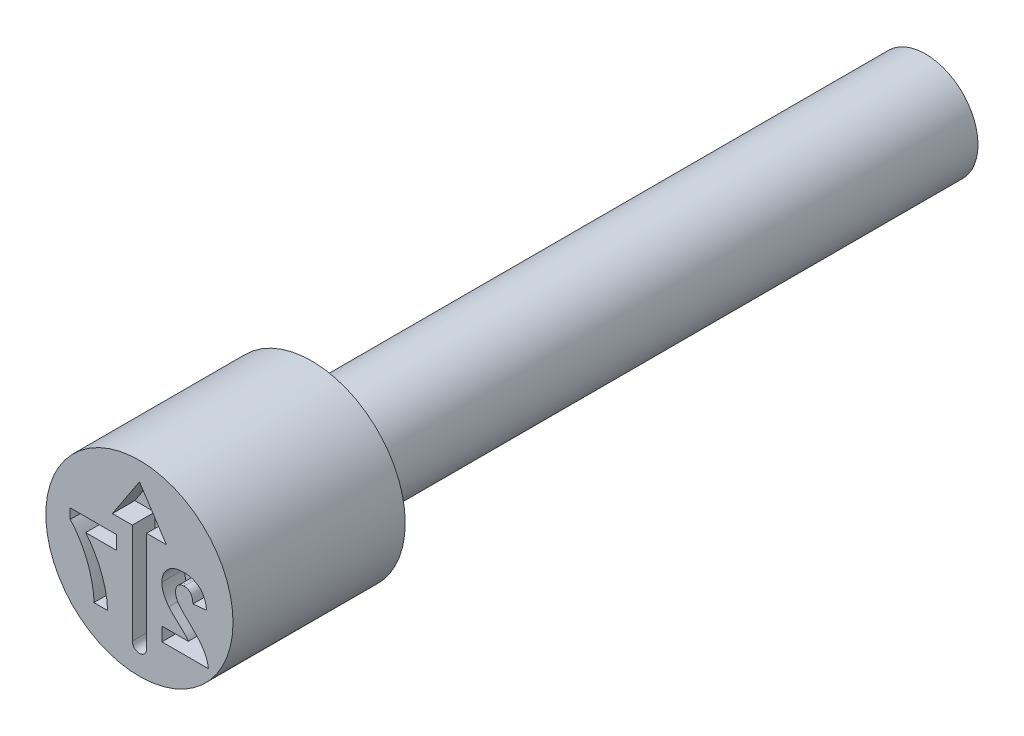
from build123d import *

# Parameters (mm, degrees)
CUT_EXTRUDE4_DEPTH = 0.3
CUT_EXTRUDE5_DEPTH = 0.3


with BuildPart() as part:
    # Sketch2 → Revolve1 (revolve)
    with BuildSketch(Plane(origin=(0, 0, 0), x_dir=(0, 0, -1), z_dir=(1, 0, 0)), mode=Mode.PRIVATE) as revolve1_sk:
        Polygon((0, 1.25), (0, 0), (10.5, 0), (10.5, 0.7), (2.3, 0.7), (2.3, 1.25), align=None)
    revolve(revolve1_sk.sketch.rotate(Axis((0, 0, -0.403888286), (0, 0, -1)), 90), axis=Axis((0, 0, -0.403888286), (0, 0, -1)))

    # Sketch3 → Cut-Extrude4 (cut)
    with BuildSketch(Plane.XY):
        with BuildLine():
            Line((0.095236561, 0.453175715), (0.095236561, -0.888080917))
            ThreePointArc((0.095236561, -0.888080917), (0, -0.983317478), (-0.095236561, -0.888080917))
            Line((-0.095236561, -0.888080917), (-0.095236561, 0.453175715))
            Line((-0.095236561, 0.453175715), (-0.360958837, 0.453175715))
            Line((-0.360958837, 0.453175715), (0, 1.001057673))
            Line((0, 1.001057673), (0.360958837, 0.453175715))
            Line((0.360958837, 0.453175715), (0.095236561, 0.453175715))
        make_face()
    extrude(amount=-CUT_EXTRUDE4_DEPTH, mode=Mode.SUBTRACT)

    # Sketch4 → Cut-Extrude5 (cut)
    with BuildSketch(Plane.XY):
        with BuildLine():
            Line((0.300150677, -0.517307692), (0.300150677, -0.7))
            Line((0.300150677, -0.7), (0.921304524, -0.7))
            add(Edge.make_bspline(
                [(0.921304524, -0.7), (0.919201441, -0.684386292), (0.914996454, -0.65316763), (0.901996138, -0.607565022), (0.884645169, -0.563064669), (0.865813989, -0.526852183), (0.847084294, -0.497702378), (0.830090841, -0.473816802), (0.809818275, -0.448403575), (0.786560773, -0.421257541), (0.760446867, -0.392293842), (0.731281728, -0.361620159), (0.698926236, -0.329383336), (0.676163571, -0.307492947), (0.664393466, -0.296173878)],
                knots=[0, 0, 0, 0, 1.156289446, 2.311930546, 3.473459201, 4.661751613, 5.303057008, 6.018253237, 6.81459331, 7.690699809, 8.644447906, 9.679642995, 10.800191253, 12, 12, 12, 12], degree=3))
            add(Edge.make_bspline(
                [(0.664393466, -0.296173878), (0.655000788, -0.287107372), (0.637119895, -0.269847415), (0.611657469, -0.245131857), (0.589273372, -0.222411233), (0.569499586, -0.202274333), (0.55279291, -0.18420842), (0.538933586, -0.168497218), (0.527746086, -0.155076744), (0.521686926, -0.146562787), (0.519000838, -0.142788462)],
                knots=[0, 0, 0, 0, 1.480720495, 2.818855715, 4.024636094, 5.098235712, 6.019786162, 6.815086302, 7.474715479, 8, 8, 8, 8], degree=3))
            add(Edge.make_bspline(
                [(0.519000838, -0.142788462), (0.513500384, -0.133651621), (0.502890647, -0.116027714), (0.49125619, -0.088313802), (0.484272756, -0.060605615), (0.483314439, -0.042091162), (0.482842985, -0.032982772)],
                knots=[0, 0, 0, 0, 1.0911822, 2.104764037, 3.067617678, 4, 4, 4, 4], degree=3))
            add(Edge.make_bspline(
                [(0.482842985, -0.032982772), (0.483185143, -0.023504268), (0.48383248, -0.005571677), (0.489260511, 0.019734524), (0.498886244, 0.041488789), (0.512139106, 0.059757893), (0.528897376, 0.074071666), (0.548488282, 0.084648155), (0.571198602, 0.090495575), (0.587160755, 0.091264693), (0.595503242, 0.091666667)],
                knots=[0, 0, 0, 0, 1.193122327, 2.257294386, 3.237245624, 4.168877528, 5.075331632, 5.990371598, 6.949684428, 8, 8, 8, 8], degree=3))
            add(Edge.make_bspline(
                [(0.595503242, 0.091666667), (0.603789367, 0.091291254), (0.619796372, 0.090566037), (0.642545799, 0.084230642), (0.662447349, 0.073263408), (0.676630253, 0.060765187), (0.686211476, 0.048611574), (0.692739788, 0.038020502), (0.698366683, 0.025985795), (0.703352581, 0.012642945), (0.707290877, -0.002160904), (0.710462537, -0.018313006), (0.713018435, -0.035900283), (0.713831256, -0.048135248), (0.714253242, -0.054487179)],
                knots=[0, 0, 0, 0, 1.402788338, 2.709884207, 3.961032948, 5.225417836, 5.883680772, 6.578928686, 7.329201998, 8.132101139, 8.990263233, 9.922304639, 10.921339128, 12, 12, 12, 12], degree=3))
            Line((0.714253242, -0.054487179), (0.896945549, -0.036598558))
            add(Edge.make_bspline(
                [(0.896945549, -0.036598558), (0.895476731, -0.024264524), (0.892628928, -0.000350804), (0.885522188, 0.033997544), (0.876521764, 0.065685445), (0.865198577, 0.094654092), (0.852020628, 0.121087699), (0.836315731, 0.144589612), (0.818632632, 0.165420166), (0.798956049, 0.183568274), (0.777411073, 0.199091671), (0.754803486, 0.212948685), (0.730691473, 0.224315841), (0.705340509, 0.233684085), (0.678762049, 0.241171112), (0.650833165, 0.246121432), (0.621726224, 0.249603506), (0.601857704, 0.249865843), (0.591697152, 0.25)],
                knots=[0, 0, 0, 0, 1.270971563, 2.464210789, 3.586263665, 4.638946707, 5.643716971, 6.603612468, 7.52484387, 8.434700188, 9.336036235, 10.239171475, 11.145359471, 12.059630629, 13.003312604, 13.96741569, 14.960557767, 16, 16, 16, 16], degree=3))
            add(Edge.make_bspline(
                [(0.591697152, 0.25), (0.580651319, 0.249787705), (0.559138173, 0.249374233), (0.527732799, 0.245959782), (0.498229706, 0.240006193), (0.470370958, 0.23211982), (0.44444265, 0.221590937), (0.420228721, 0.208861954), (0.398110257, 0.193449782), (0.377757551, 0.176194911), (0.359563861, 0.157220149), (0.343627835, 0.136980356), (0.330276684, 0.115489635), (0.319073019, 0.093009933), (0.310754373, 0.06917952), (0.304693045, 0.044327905), (0.300674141, 0.018339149), (0.300327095, 0.000589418), (0.300150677, -0.008433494)],
                knots=[0, 0, 0, 0, 1.210756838, 2.35810096, 3.457354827, 4.507168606, 5.527358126, 6.519769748, 7.499700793, 8.476517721, 9.440526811, 10.376769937, 11.295256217, 12.209626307, 13.124630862, 14.055668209, 15.011616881, 16, 16, 16, 16], degree=3))
            add(Edge.make_bspline(
                [(0.300150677, -0.008433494), (0.300383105, -0.01878893), (0.300844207, -0.039332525), (0.305258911, -0.069702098), (0.31200372, -0.099371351), (0.321972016, -0.128412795), (0.334607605, -0.157523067), (0.350895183, -0.186767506), (0.369806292, -0.217028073), (0.384612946, -0.236592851), (0.392258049, -0.246694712)],
                knots=[0, 0, 0, 0, 0.953409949, 1.89141903, 2.821310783, 3.752688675, 4.715703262, 5.740811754, 6.833515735, 8, 8, 8, 8], degree=3))
            add(Edge.make_bspline(
                [(0.392258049, -0.246694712), (0.395147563, -0.250334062), (0.401336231, -0.258128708), (0.411864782, -0.270080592), (0.424066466, -0.283135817), (0.437768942, -0.297538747), (0.453424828, -0.312779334), (0.470470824, -0.329494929), (0.489657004, -0.346830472), (0.509529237, -0.365218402), (0.529487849, -0.383115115), (0.547832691, -0.400113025), (0.564495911, -0.415152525), (0.578701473, -0.429063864), (0.591284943, -0.440897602), (0.601792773, -0.451260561), (0.610421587, -0.459901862), (0.622311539, -0.473371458), (0.637440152, -0.491589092), (0.648083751, -0.508996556), (0.653165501, -0.517307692)],
                knots=[0, 0, 0, 0, 0.665555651, 1.425465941, 2.280616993, 3.225313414, 4.272635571, 5.410053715, 6.644756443, 7.976022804, 9.288331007, 10.484517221, 11.558462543, 12.503158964, 13.33222979, 14.032602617, 14.617328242, 15.080653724, 16.606167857, 18, 18, 18, 18], degree=3))
            Line((0.653165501, -0.517307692), (0.300150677, -0.517307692))
        make_face()
        with BuildLine():
            Line((-0.303464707, 0.055128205), (-0.303464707, 0.237820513))
            Line((-0.303464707, 0.237820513), (-0.924618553, 0.237820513))
            Line((-0.924618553, 0.237820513), (-0.924618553, 0.103846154))
            add(Edge.make_bspline(
                [(-0.924618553, 0.103846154), (-0.918138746, 0.097253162), (-0.904818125, 0.083699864), (-0.885737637, 0.061518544), (-0.866374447, 0.03744792), (-0.847133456, 0.011163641), (-0.82741657, -0.016919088), (-0.808090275, -0.047338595), (-0.788489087, -0.079700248), (-0.762099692, -0.125475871), (-0.731253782, -0.185272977), (-0.698620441, -0.259603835), (-0.670818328, -0.336217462), (-0.651780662, -0.401497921), (-0.638917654, -0.453820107), (-0.630513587, -0.49207933), (-0.623439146, -0.529261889), (-0.617684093, -0.565433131), (-0.613388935, -0.600609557), (-0.609995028, -0.634668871), (-0.608320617, -0.667694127), (-0.60807354, -0.689341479), (-0.607951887, -0.7)],
                knots=[0, 0, 0, 0, 0.628545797, 1.29210959, 1.98878689, 2.729126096, 3.507039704, 4.322017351, 5.179550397, 6.080149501, 7.915136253, 9.752312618, 11.597470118, 13.454141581, 14.373891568, 15.261584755, 16.117868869, 16.947726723, 17.752002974, 18.527724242, 19.275094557, 20, 20, 20, 20], degree=3))
            Line((-0.607951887, -0.7), (-0.425259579, -0.7))
            add(Edge.make_bspline(
                [(-0.425259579, -0.7), (-0.425870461, -0.683815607), (-0.427099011, -0.651267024), (-0.43169557, -0.602412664), (-0.43891496, -0.553376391), (-0.447881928, -0.504044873), (-0.45972056, -0.454538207), (-0.473232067, -0.404673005), (-0.489599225, -0.354715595), (-0.507946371, -0.3047615), (-0.528200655, -0.255284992), (-0.550274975, -0.206899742), (-0.574112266, -0.159907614), (-0.59940253, -0.114143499), (-0.626439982, -0.069754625), (-0.655244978, -0.026789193), (-0.685408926, 0.015063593), (-0.706976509, 0.041775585), (-0.717757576, 0.055128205)],
                knots=[0, 0, 0, 0, 0.943249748, 1.896978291, 2.856365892, 3.829648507, 4.816416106, 5.820376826, 6.838120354, 7.877341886, 8.919613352, 9.951365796, 10.974227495, 11.988073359, 12.996274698, 14.000568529, 15.000536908, 16, 16, 16, 16], degree=3))
            Line((-0.717757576, 0.055128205), (-0.303464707, 0.055128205))
        make_face()
    extrude(amount=-CUT_EXTRUDE5_DEPTH, mode=Mode.SUBTRACT)


solid = part.part
